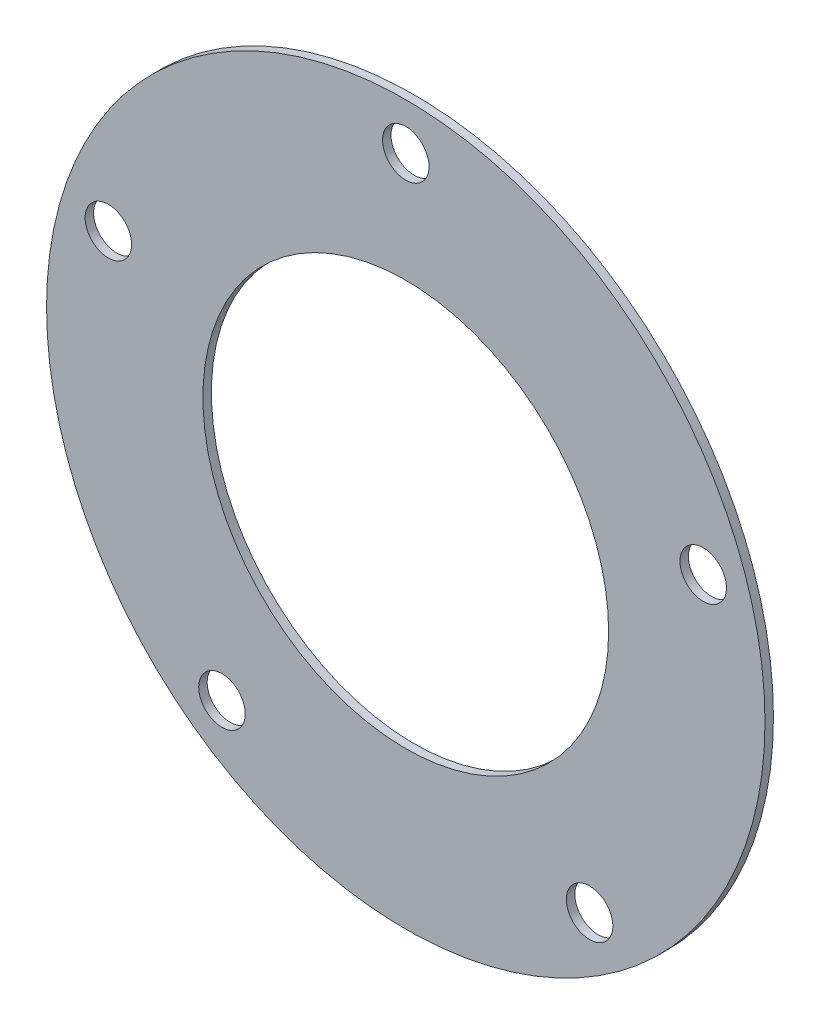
from build123d import *

# Parameters (mm, degrees)
ESQUISSE1_R                  = 42.5
ESQUISSE1_R_2                = 24
BASE_EXTRUSION_DEPTH         = 1
ESQUISSE2_R                  = 2.75
ENL_V_MAT_EXTRU_1_DEPTH      = 61.112394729
R_P_TITION_CIRCULAIRE1_COUNT = 5


with BuildPart() as part:
    # Esquisse1 → Base-Extrusion (new body)
    with BuildSketch(Plane.XY):
        Circle(ESQUISSE1_R)
        Circle(ESQUISSE1_R_2, mode=Mode.SUBTRACT)
    extrude(amount=BASE_EXTRUSION_DEPTH)

    # Esquisse2 → Enl_v. mat.-Extru.1 (cut, through all)
    with BuildSketch(Plane.XY.offset(1)):
        with Locations((0, 37)):
            Circle(ESQUISSE2_R)
    enl_v_mat_extru_1 = extrude(amount=-ENL_V_MAT_EXTRU_1_DEPTH, mode=Mode.SUBTRACT)

    # R_p_tition circulaire1: Enl_v. mat.-Extru.1 ×5 about axis
    r_p_tition_circulaire1_axis = Axis((0, 0, 51), (0, 0, -1))
    for i in range(1, R_P_TITION_CIRCULAIRE1_COUNT):
        add(enl_v_mat_extru_1.rotate(r_p_tition_circulaire1_axis, i * 360 / R_P_TITION_CIRCULAIRE1_COUNT), mode=Mode.SUBTRACT)


solid = part.part
